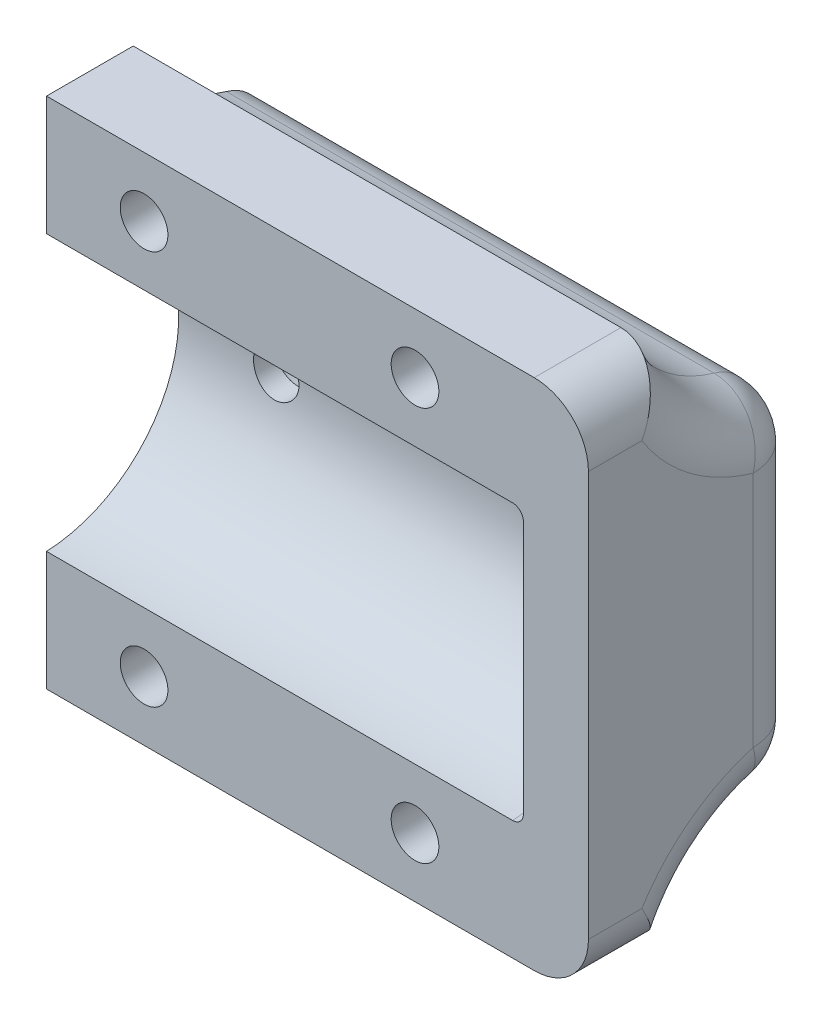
from build123d import *

# Parameters (mm, degrees)
BOSS_EXTRUDE1_DEPTH = 50
BOSS_EXTRUDE2_START = -6
BOSS_EXTRUDE2_DEPTH = 6
FILLET1_R           = 1
SKETCH3_R           = 2.1
CUT_EXTRUDE1_DEPTH  = 59.900453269
FILLET2_R           = 5
SKETCH4_R           = 6
CUT_EXTRUDE2_DEPTH  = 6
SKETCH5_R           = 2.1
CUT_EXTRUDE3_DEPTH  = 58.121479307
SKETCH7_R           = 2.2
CUT_EXTRUDE4_DEPTH  = 5
FILLET3_R           = 1
SKETCH8_R           = 2.2
CUT_EXTRUDE5_DEPTH  = 5


with BuildPart() as part:
    # Sketch1 → Boss-Extrude1 (new body)
    with BuildSketch(Plane.YZ):
        with BuildLine():
            Line((-12.690153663, 0), (-23.690153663, 0))
            Line((-23.690153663, 0), (-23.690153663, -8))
            ThreePointArc((-23.690153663, -8), (-17.565693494, -12.782517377), (-15.25, -20.2))
            Line((-15.25, -20.2), (15.25, -20.2))
            ThreePointArc((15.25, -20.2), (17.565693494, -12.782517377), (23.690153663, -8))
            Line((23.690153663, -8), (23.690153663, 0))
            Line((23.690153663, 0), (12.690153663, 0))
            ThreePointArc((12.690153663, 0), (0, -12.2), (-12.690153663, 0))
        make_face()
    extrude(amount=BOSS_EXTRUDE1_DEPTH)

    # Sketch2 → Boss-Extrude2 (add)
    with BuildSketch(Plane.YZ.offset(50).offset(BOSS_EXTRUDE2_START)):
        with BuildLine():
            Line((-12.690153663, 0), (12.690153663, 0))
            ThreePointArc((12.690153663, 0), (0, -12.2), (-12.690153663, 0))
        make_face()
    extrude(amount=BOSS_EXTRUDE2_DEPTH)

    # Fillet1
    fillet1_edges = [part.edges().sort_by_distance(p)[0] for p in [
        (44, 0, -12.2),
    ]]
    fillet(fillet1_edges, radius=FILLET1_R)

    # Sketch3 → Cut-Extrude1 (cut, through all)
    with BuildSketch(Plane.XY):
        with Locations((9, 18.190153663)):
            Circle(SKETCH3_R)
        with Locations((34, 18.190153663)):
            Circle(SKETCH3_R)
        with Locations((9, -18.190153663)):
            Circle(SKETCH3_R)
        with Locations((34, -18.190153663)):
            Circle(SKETCH3_R)
    extrude(amount=-CUT_EXTRUDE1_DEPTH, mode=Mode.SUBTRACT)

    # Fillet2
    fillet2_edges = [part.edges().sort_by_distance(p)[0] for p in [
        (50, -23.690153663, -4),
        (25, 15.25, -20.2),
        (25, -15.25, -20.2),
        (50, -17.565693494, -12.782517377),
        (50, 0, -20.2),
        (50, 17.565693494, -12.782517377),
        (50, 23.690153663, -4),
    ]]
    fillet(fillet2_edges, radius=FILLET2_R)

    # Sketch4 → Cut-Extrude2 (cut)
    with BuildSketch(Plane(origin=(0, 0, -20.2), x_dir=(1, 0, 0), z_dir=(0, 0, -1))):
        with Locations(Location((9, 0, 0), (0, 0, 180))):
            Circle(SKETCH4_R)
        with Locations(Location((34, 0, 0), (0, 0, 180))):
            Circle(SKETCH4_R)
    extrude(amount=-CUT_EXTRUDE2_DEPTH, mode=Mode.SUBTRACT)

    # Sketch5 → Cut-Extrude3 (cut, through all)
    with BuildSketch(Plane(origin=(0, 0, -14.2), x_dir=(1, 0, 0), z_dir=(0, 0, -1))):
        with Locations(Location((9, 0, 0), (0, 0, 180))):
            Circle(SKETCH5_R)
        with Locations(Location((34, 0, 0), (0, 0, 180))):
            Circle(SKETCH5_R)
    extrude(amount=-CUT_EXTRUDE3_DEPTH, mode=Mode.SUBTRACT)

    # Sketch7 → Cut-Extrude4 (cut)
    with BuildSketch(Plane.XY):
        with Locations((9, -18.190153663)):
            Circle(SKETCH7_R)
        with Locations((34, -18.190153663)):
            Circle(SKETCH7_R)
        with Locations((9, 18.190153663)):
            Circle(SKETCH7_R)
        with Locations((34, 18.190153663)):
            Circle(SKETCH7_R)
    extrude(amount=-CUT_EXTRUDE4_DEPTH, mode=Mode.SUBTRACT)

    # Fillet3
    fillet3_edges = [part.edges().sort_by_distance(p)[0] for p in [
        (15, 0, -14.2),
        (40, 0, -14.2),
    ]]
    fillet(fillet3_edges, radius=FILLET3_R)

    # Sketch8 → Cut-Extrude5 (cut)
    with BuildSketch(Plane(origin=(0, 0, -20.2), x_dir=(1, 0, 0), z_dir=(0, 0, -1))):
        with Locations(Location((21.5, 0, 0), (0, 0, 180))):
            Circle(SKETCH8_R)
    extrude(amount=-CUT_EXTRUDE5_DEPTH, mode=Mode.SUBTRACT)


solid = part.part
